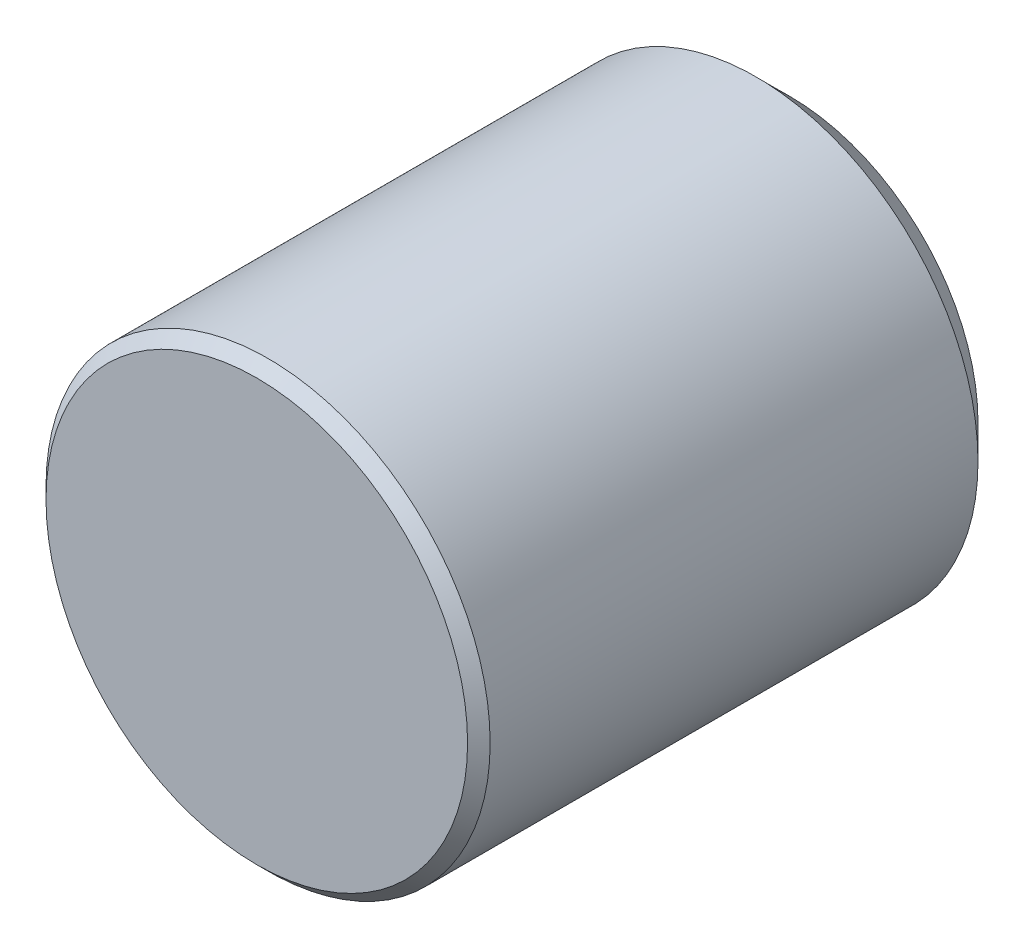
ISO-10303-21;
HEADER;
FILE_DESCRIPTION(('STEP AP214'),'2;1');
FILE_NAME('part.step','',(''),(''),'','','');
FILE_SCHEMA(('AUTOMOTIVE_DESIGN { 1 0 10303 214 1 1 1 1 }'));
ENDSEC;
DATA;
#1=APPLICATION_CONTEXT('core data for automotive mechanical design processes');
#2=APPLICATION_PROTOCOL_DEFINITION('international standard','automotive_design',2000,#1);
#3=PRODUCT_CONTEXT('',#1,'mechanical');
#4=PRODUCT('Part','Part','',(#3));
#5=PRODUCT_RELATED_PRODUCT_CATEGORY('part','',(#4));
#6=PRODUCT_DEFINITION_FORMATION('','',#4);
#7=PRODUCT_DEFINITION_CONTEXT('part definition',#1,'design');
#8=PRODUCT_DEFINITION('design','',#6,#7);
#9=PRODUCT_DEFINITION_SHAPE('','',#8);
#10=(LENGTH_UNIT() NAMED_UNIT(*) SI_UNIT(.MILLI.,.METRE.));
#11=(NAMED_UNIT(*) PLANE_ANGLE_UNIT() SI_UNIT($,.RADIAN.));
#12=(NAMED_UNIT(*) SI_UNIT($,.STERADIAN.) SOLID_ANGLE_UNIT());
#13=UNCERTAINTY_MEASURE_WITH_UNIT(LENGTH_MEASURE(1.E-05),#10,'distance_accuracy_value','');
#14=(GEOMETRIC_REPRESENTATION_CONTEXT(3) GLOBAL_UNCERTAINTY_ASSIGNED_CONTEXT((#13)) GLOBAL_UNIT_ASSIGNED_CONTEXT((#10,
#11,#12)) REPRESENTATION_CONTEXT('',''));
#15=CARTESIAN_POINT('',(0.,0.,0.));
#16=DIRECTION('',(0.,0.,1.));
#17=DIRECTION('',(1.,0.,0.));
#18=AXIS2_PLACEMENT_3D('',#15,#16,#17);
#19=CARTESIAN_POINT('',(0.,0.,0.));
#20=DIRECTION('',(0.,0.,1.));
#21=DIRECTION('',(1.,0.,0.));
#22=AXIS2_PLACEMENT_3D('',#19,#20,#21);
#23=PLANE('',#22);
#24=CARTESIAN_POINT('',(0.,0.,0.));
#25=DIRECTION('',(0.,0.,-1.));
#26=DIRECTION('',(-1.,0.,0.));
#27=AXIS2_PLACEMENT_3D('',#24,#25,#26);
#28=CIRCLE('',#27,2.5);
#29=CARTESIAN_POINT('',(-2.5,0.,0.));
#30=VERTEX_POINT('',#29);
#31=EDGE_CURVE('E33',#30,#30,#28,.T.);
#32=ORIENTED_EDGE('',*,*,#31,.F.);
#33=EDGE_LOOP('',(#32));
#34=FACE_BOUND('',#33,.T.);
#35=CARTESIAN_POINT('',(0.,0.,0.));
#36=DIRECTION('',(0.,0.,1.));
#37=DIRECTION('',(1.,0.,0.));
#38=AXIS2_PLACEMENT_3D('',#35,#36,#37);
#39=CIRCLE('',#38,4.238);
#40=CARTESIAN_POINT('',(4.238,0.,0.));
#41=VERTEX_POINT('',#40);
#42=EDGE_CURVE('E23',#41,#41,#39,.F.);
#43=ORIENTED_EDGE('',*,*,#42,.T.);
#44=EDGE_LOOP('',(#43));
#45=FACE_BOUND('',#44,.T.);
#46=ADVANCED_FACE('F12',(#34,#45),#23,.F.);
#47=CARTESIAN_POINT('',(0.,0.,12.));
#48=DIRECTION('',(0.,0.,-1.));
#49=DIRECTION('',(-1.,0.,0.));
#50=AXIS2_PLACEMENT_3D('',#47,#48,#49);
#51=CYLINDRICAL_SURFACE('',#50,5.);
#52=CARTESIAN_POINT('',(0.,0.,11.746));
#53=DIRECTION('',(0.,0.,1.));
#54=DIRECTION('',(1.,0.,0.));
#55=AXIS2_PLACEMENT_3D('',#52,#53,#54);
#56=CIRCLE('',#55,5.);
#57=CARTESIAN_POINT('',(5.,0.,11.746));
#58=VERTEX_POINT('',#57);
#59=EDGE_CURVE('E8',#58,#58,#56,.F.);
#60=ORIENTED_EDGE('',*,*,#59,.T.);
#61=EDGE_LOOP('',(#60));
#62=FACE_BOUND('',#61,.T.);
#63=CARTESIAN_POINT('',(0.,0.,0.762));
#64=DIRECTION('',(0.,0.,1.));
#65=DIRECTION('',(1.,0.,0.));
#66=AXIS2_PLACEMENT_3D('',#63,#64,#65);
#67=CIRCLE('',#66,5.);
#68=CARTESIAN_POINT('',(5.,0.,0.762));
#69=VERTEX_POINT('',#68);
#70=EDGE_CURVE('E27',#69,#69,#67,.T.);
#71=ORIENTED_EDGE('',*,*,#70,.T.);
#72=EDGE_LOOP('',(#71));
#73=FACE_BOUND('',#72,.T.);
#74=ADVANCED_FACE('F49',(#62,#73),#51,.T.);
#75=CARTESIAN_POINT('',(0.,0.,12.));
#76=DIRECTION('',(0.,0.,1.));
#77=DIRECTION('',(1.,0.,0.));
#78=AXIS2_PLACEMENT_3D('',#75,#76,#77);
#79=PLANE('',#78);
#80=CARTESIAN_POINT('',(0.,0.,12.));
#81=DIRECTION('',(0.,0.,1.));
#82=DIRECTION('',(1.,0.,0.));
#83=AXIS2_PLACEMENT_3D('',#80,#81,#82);
#84=CIRCLE('',#83,4.746);
#85=CARTESIAN_POINT('',(4.746,0.,12.));
#86=VERTEX_POINT('',#85);
#87=EDGE_CURVE('E19',#86,#86,#84,.T.);
#88=ORIENTED_EDGE('',*,*,#87,.T.);
#89=EDGE_LOOP('',(#88));
#90=FACE_BOUND('',#89,.T.);
#91=ADVANCED_FACE('F56',(#90),#79,.T.);
#92=CARTESIAN_POINT('',(0.,0.,0.762));
#93=DIRECTION('',(0.,0.,1.));
#94=DIRECTION('',(1.,0.,0.));
#95=AXIS2_PLACEMENT_3D('',#92,#93,#94);
#96=CONICAL_SURFACE('',#95,5.,0.78539816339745);
#97=ORIENTED_EDGE('',*,*,#42,.F.);
#98=EDGE_LOOP('',(#97));
#99=FACE_BOUND('',#98,.T.);
#100=ORIENTED_EDGE('',*,*,#70,.F.);
#101=EDGE_LOOP('',(#100));
#102=FACE_BOUND('',#101,.T.);
#103=ADVANCED_FACE('F53',(#99,#102),#96,.T.);
#104=CARTESIAN_POINT('',(0.,0.,12.));
#105=DIRECTION('',(0.,0.,-1.));
#106=DIRECTION('',(-1.,0.,0.));
#107=AXIS2_PLACEMENT_3D('',#104,#105,#106);
#108=CONICAL_SURFACE('',#107,4.746,0.785398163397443);
#109=ORIENTED_EDGE('',*,*,#59,.F.);
#110=EDGE_LOOP('',(#109));
#111=FACE_BOUND('',#110,.T.);
#112=ORIENTED_EDGE('',*,*,#87,.F.);
#113=EDGE_LOOP('',(#112));
#114=FACE_BOUND('',#113,.T.);
#115=ADVANCED_FACE('F14',(#111,#114),#108,.T.);
#116=CARTESIAN_POINT('',(0.,0.,6.4));
#117=DIRECTION('',(0.,0.,-1.));
#118=DIRECTION('',(-1.,0.,0.));
#119=AXIS2_PLACEMENT_3D('',#116,#117,#118);
#120=CYLINDRICAL_SURFACE('',#119,2.5);
#121=CARTESIAN_POINT('',(0.,0.,6.4));
#122=DIRECTION('',(0.,0.,-1.));
#123=DIRECTION('',(-1.,0.,0.));
#124=AXIS2_PLACEMENT_3D('',#121,#122,#123);
#125=CIRCLE('',#124,2.5);
#126=CARTESIAN_POINT('',(-2.5,0.,6.4));
#127=VERTEX_POINT('',#126);
#128=EDGE_CURVE('E32',#127,#127,#125,.T.);
#129=ORIENTED_EDGE('',*,*,#128,.F.);
#130=EDGE_LOOP('',(#129));
#131=FACE_BOUND('',#130,.T.);
#132=ORIENTED_EDGE('',*,*,#31,.T.);
#133=EDGE_LOOP('',(#132));
#134=FACE_BOUND('',#133,.T.);
#135=ADVANCED_FACE('F41',(#131,#134),#120,.F.);
#136=CARTESIAN_POINT('',(0.,0.,6.4));
#137=DIRECTION('',(0.,0.,-1.));
#138=DIRECTION('',(-1.,0.,0.));
#139=AXIS2_PLACEMENT_3D('',#136,#137,#138);
#140=PLANE('',#139);
#141=ORIENTED_EDGE('',*,*,#128,.T.);
#142=EDGE_LOOP('',(#141));
#143=FACE_BOUND('',#142,.T.);
#144=ADVANCED_FACE('F39',(#143),#140,.T.);
#145=CLOSED_SHELL('',(#46,#74,#91,#103,#115,#135,#144));
#146=MANIFOLD_SOLID_BREP('B1',#145);
#147=ADVANCED_BREP_SHAPE_REPRESENTATION('',(#18,#146),#14);
#148=SHAPE_DEFINITION_REPRESENTATION(#9,#147);
ENDSEC;
END-ISO-10303-21;
